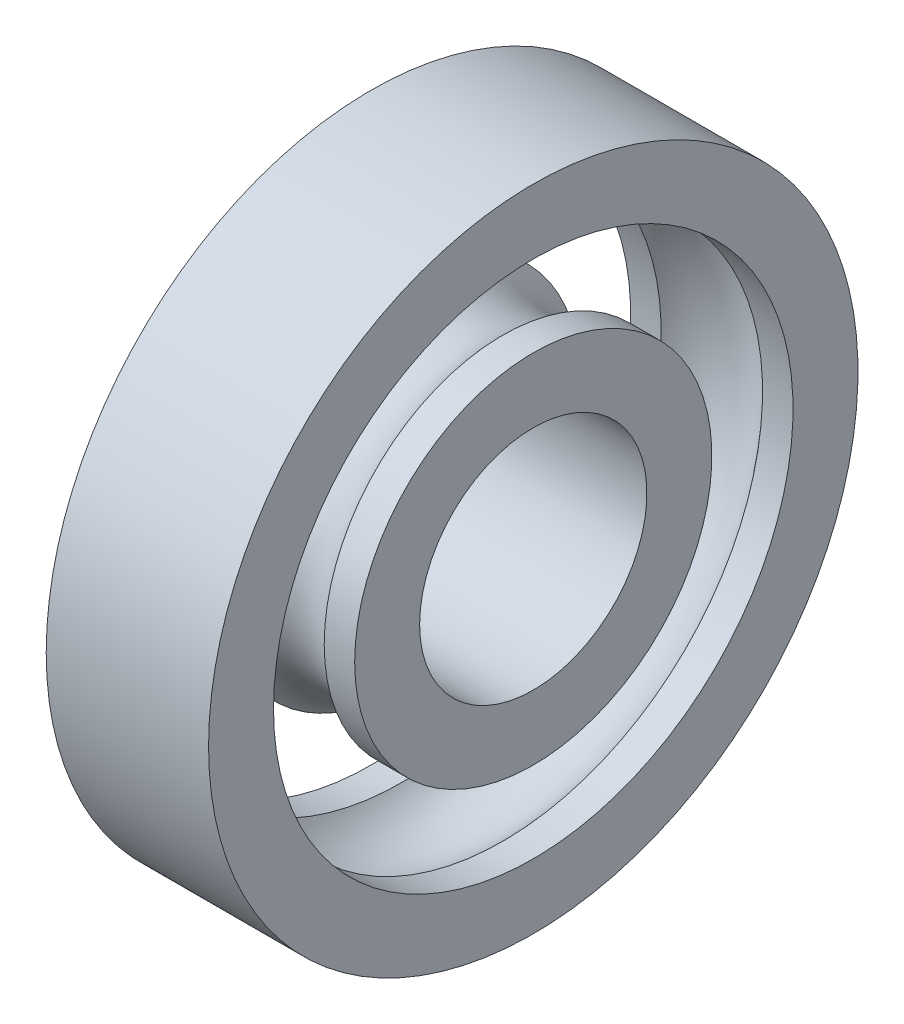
ISO-10303-21;
HEADER;
FILE_DESCRIPTION(('STEP AP214'),'2;1');
FILE_NAME('part.step','',(''),(''),'','','');
FILE_SCHEMA(('AUTOMOTIVE_DESIGN { 1 0 10303 214 1 1 1 1 }'));
ENDSEC;
DATA;
#1=APPLICATION_CONTEXT('core data for automotive mechanical design processes');
#2=APPLICATION_PROTOCOL_DEFINITION('international standard','automotive_design',2000,#1);
#3=PRODUCT_CONTEXT('',#1,'mechanical');
#4=PRODUCT('Part','Part','',(#3));
#5=PRODUCT_RELATED_PRODUCT_CATEGORY('part','',(#4));
#6=PRODUCT_DEFINITION_FORMATION('','',#4);
#7=PRODUCT_DEFINITION_CONTEXT('part definition',#1,'design');
#8=PRODUCT_DEFINITION('design','',#6,#7);
#9=PRODUCT_DEFINITION_SHAPE('','',#8);
#10=(LENGTH_UNIT() NAMED_UNIT(*) SI_UNIT(.MILLI.,.METRE.));
#11=(NAMED_UNIT(*) PLANE_ANGLE_UNIT() SI_UNIT($,.RADIAN.));
#12=(NAMED_UNIT(*) SI_UNIT($,.STERADIAN.) SOLID_ANGLE_UNIT());
#13=UNCERTAINTY_MEASURE_WITH_UNIT(LENGTH_MEASURE(1.E-05),#10,'distance_accuracy_value','');
#14=(GEOMETRIC_REPRESENTATION_CONTEXT(3) GLOBAL_UNCERTAINTY_ASSIGNED_CONTEXT((#13)) GLOBAL_UNIT_ASSIGNED_CONTEXT((#10,
#11,#12)) REPRESENTATION_CONTEXT('',''));
#15=CARTESIAN_POINT('',(0.,0.,0.));
#16=DIRECTION('',(0.,0.,1.));
#17=DIRECTION('',(1.,0.,0.));
#18=AXIS2_PLACEMENT_3D('',#15,#16,#17);
#19=CARTESIAN_POINT('',(-5.5398835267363,0.,0.));
#20=DIRECTION('',(-1.,0.,0.));
#21=DIRECTION('',(0.,0.,1.));
#22=AXIS2_PLACEMENT_3D('',#19,#20,#21);
#23=CYLINDRICAL_SURFACE('',#22,11.);
#24=CARTESIAN_POINT('',(-5.,0.,0.));
#25=DIRECTION('',(-1.,0.,0.));
#26=DIRECTION('',(0.,0.,1.));
#27=AXIS2_PLACEMENT_3D('',#24,#25,#26);
#28=CIRCLE('',#27,11.);
#29=CARTESIAN_POINT('',(-5.,0.,11.));
#30=VERTEX_POINT('',#29);
#31=EDGE_CURVE('E11',#30,#30,#28,.T.);
#32=ORIENTED_EDGE('',*,*,#31,.F.);
#33=EDGE_LOOP('',(#32));
#34=FACE_BOUND('',#33,.T.);
#35=CARTESIAN_POINT('',(-3.12249899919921,0.,0.));
#36=DIRECTION('',(-1.,0.,0.));
#37=DIRECTION('',(0.,0.,1.));
#38=AXIS2_PLACEMENT_3D('',#35,#36,#37);
#39=CIRCLE('',#38,11.);
#40=CARTESIAN_POINT('',(-3.12249899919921,0.,11.));
#41=VERTEX_POINT('',#40);
#42=EDGE_CURVE('E61',#41,#41,#39,.T.);
#43=ORIENTED_EDGE('',*,*,#42,.T.);
#44=EDGE_LOOP('',(#43));
#45=FACE_BOUND('',#44,.T.);
#46=ADVANCED_FACE('F39',(#34,#45),#23,.T.);
#47=CARTESIAN_POINT('',(-5.,7.,0.));
#48=DIRECTION('',(1.,0.,0.));
#49=DIRECTION('',(0.,0.,-1.));
#50=AXIS2_PLACEMENT_3D('',#47,#48,#49);
#51=PLANE('',#50);
#52=CARTESIAN_POINT('',(-5.,0.,0.));
#53=DIRECTION('',(-1.,0.,0.));
#54=DIRECTION('',(0.,0.,1.));
#55=AXIS2_PLACEMENT_3D('',#52,#53,#54);
#56=CIRCLE('',#55,7.);
#57=CARTESIAN_POINT('',(-5.,0.,7.));
#58=VERTEX_POINT('',#57);
#59=EDGE_CURVE('E45',#58,#58,#56,.T.);
#60=ORIENTED_EDGE('',*,*,#59,.F.);
#61=EDGE_LOOP('',(#60));
#62=FACE_BOUND('',#61,.T.);
#63=ORIENTED_EDGE('',*,*,#31,.T.);
#64=EDGE_LOOP('',(#63));
#65=FACE_BOUND('',#64,.T.);
#66=ADVANCED_FACE('F86',(#62,#65),#51,.F.);
#67=CARTESIAN_POINT('',(-5.5398835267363,0.,0.));
#68=DIRECTION('',(-1.,0.,0.));
#69=DIRECTION('',(0.,0.,1.));
#70=AXIS2_PLACEMENT_3D('',#67,#68,#69);
#71=CYLINDRICAL_SURFACE('',#70,7.);
#72=CARTESIAN_POINT('',(5.,0.,0.));
#73=DIRECTION('',(-1.,0.,0.));
#74=DIRECTION('',(0.,0.,1.));
#75=AXIS2_PLACEMENT_3D('',#72,#73,#74);
#76=CIRCLE('',#75,7.);
#77=CARTESIAN_POINT('',(5.,0.,7.));
#78=VERTEX_POINT('',#77);
#79=EDGE_CURVE('E49',#78,#78,#76,.T.);
#80=ORIENTED_EDGE('',*,*,#79,.F.);
#81=EDGE_LOOP('',(#80));
#82=FACE_BOUND('',#81,.T.);
#83=ORIENTED_EDGE('',*,*,#59,.T.);
#84=EDGE_LOOP('',(#83));
#85=FACE_BOUND('',#84,.T.);
#86=ADVANCED_FACE('F81',(#82,#85),#71,.F.);
#87=CARTESIAN_POINT('',(5.,7.,0.));
#88=DIRECTION('',(-1.,0.,0.));
#89=DIRECTION('',(0.,0.,1.));
#90=AXIS2_PLACEMENT_3D('',#87,#88,#89);
#91=PLANE('',#90);
#92=CARTESIAN_POINT('',(5.,0.,0.));
#93=DIRECTION('',(-1.,0.,0.));
#94=DIRECTION('',(0.,0.,1.));
#95=AXIS2_PLACEMENT_3D('',#92,#93,#94);
#96=CIRCLE('',#95,11.);
#97=CARTESIAN_POINT('',(5.,0.,11.));
#98=VERTEX_POINT('',#97);
#99=EDGE_CURVE('E53',#98,#98,#96,.T.);
#100=ORIENTED_EDGE('',*,*,#99,.F.);
#101=EDGE_LOOP('',(#100));
#102=FACE_BOUND('',#101,.T.);
#103=ORIENTED_EDGE('',*,*,#79,.T.);
#104=EDGE_LOOP('',(#103));
#105=FACE_BOUND('',#104,.T.);
#106=ADVANCED_FACE('F75',(#102,#105),#91,.F.);
#107=CARTESIAN_POINT('',(-5.5398835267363,0.,0.));
#108=DIRECTION('',(-1.,0.,0.));
#109=DIRECTION('',(0.,0.,1.));
#110=AXIS2_PLACEMENT_3D('',#107,#108,#109);
#111=CYLINDRICAL_SURFACE('',#110,11.);
#112=CARTESIAN_POINT('',(3.12249899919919,0.,0.));
#113=DIRECTION('',(-1.,0.,0.));
#114=DIRECTION('',(0.,0.,1.));
#115=AXIS2_PLACEMENT_3D('',#112,#113,#114);
#116=CIRCLE('',#115,11.);
#117=CARTESIAN_POINT('',(3.12249899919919,0.,11.));
#118=VERTEX_POINT('',#117);
#119=EDGE_CURVE('E58',#118,#118,#116,.T.);
#120=ORIENTED_EDGE('',*,*,#119,.F.);
#121=EDGE_LOOP('',(#120));
#122=FACE_BOUND('',#121,.T.);
#123=ORIENTED_EDGE('',*,*,#99,.T.);
#124=EDGE_LOOP('',(#123));
#125=FACE_BOUND('',#124,.T.);
#126=ADVANCED_FACE('F69',(#122,#125),#111,.T.);
#127=CARTESIAN_POINT('',(0.,0.,0.));
#128=DIRECTION('',(-1.,0.,0.));
#129=DIRECTION('',(0.,0.,1.));
#130=AXIS2_PLACEMENT_3D('',#127,#128,#129);
#131=TOROIDAL_SURFACE('',#130,13.5,4.);
#132=ORIENTED_EDGE('',*,*,#42,.F.);
#133=EDGE_LOOP('',(#132));
#134=FACE_BOUND('',#133,.T.);
#135=ORIENTED_EDGE('',*,*,#119,.T.);
#136=EDGE_LOOP('',(#135));
#137=FACE_BOUND('',#136,.T.);
#138=ADVANCED_FACE('F66',(#134,#137),#131,.F.);
#139=CLOSED_SHELL('',(#46,#66,#86,#106,#126,#138));
#140=MANIFOLD_SOLID_BREP('B2',#139);
#141=CARTESIAN_POINT('',(-4.99999999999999,16.,0.));
#142=DIRECTION('',(1.,0.,0.));
#143=DIRECTION('',(0.,0.,-1.));
#144=AXIS2_PLACEMENT_3D('',#141,#142,#143);
#145=PLANE('',#144);
#146=CARTESIAN_POINT('',(-4.99999999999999,0.,0.));
#147=DIRECTION('',(-1.,0.,0.));
#148=DIRECTION('',(0.,0.,1.));
#149=AXIS2_PLACEMENT_3D('',#146,#147,#148);
#150=CIRCLE('',#149,16.);
#151=CARTESIAN_POINT('',(-4.99999999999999,0.,16.));
#152=VERTEX_POINT('',#151);
#153=EDGE_CURVE('E38',#152,#152,#150,.T.);
#154=ORIENTED_EDGE('',*,*,#153,.F.);
#155=EDGE_LOOP('',(#154));
#156=FACE_BOUND('',#155,.T.);
#157=CARTESIAN_POINT('',(-4.99999999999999,0.,0.));
#158=DIRECTION('',(-1.,0.,0.));
#159=DIRECTION('',(0.,0.,1.));
#160=AXIS2_PLACEMENT_3D('',#157,#158,#159);
#161=CIRCLE('',#160,20.);
#162=CARTESIAN_POINT('',(-4.99999999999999,0.,20.));
#163=VERTEX_POINT('',#162);
#164=EDGE_CURVE('E153',#163,#163,#161,.T.);
#165=ORIENTED_EDGE('',*,*,#164,.T.);
#166=EDGE_LOOP('',(#165));
#167=FACE_BOUND('',#166,.T.);
#168=ADVANCED_FACE('F131',(#156,#167),#145,.F.);
#169=CARTESIAN_POINT('',(-5.5398835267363,0.,0.));
#170=DIRECTION('',(-1.,0.,0.));
#171=DIRECTION('',(0.,0.,1.));
#172=AXIS2_PLACEMENT_3D('',#169,#170,#171);
#173=CYLINDRICAL_SURFACE('',#172,16.);
#174=CARTESIAN_POINT('',(-3.12249899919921,0.,0.));
#175=DIRECTION('',(-1.,0.,0.));
#176=DIRECTION('',(0.,0.,1.));
#177=AXIS2_PLACEMENT_3D('',#174,#175,#176);
#178=CIRCLE('',#177,16.);
#179=CARTESIAN_POINT('',(-3.12249899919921,0.,16.));
#180=VERTEX_POINT('',#179);
#181=EDGE_CURVE('E137',#180,#180,#178,.T.);
#182=ORIENTED_EDGE('',*,*,#181,.F.);
#183=EDGE_LOOP('',(#182));
#184=FACE_BOUND('',#183,.T.);
#185=ORIENTED_EDGE('',*,*,#153,.T.);
#186=EDGE_LOOP('',(#185));
#187=FACE_BOUND('',#186,.T.);
#188=ADVANCED_FACE('F178',(#184,#187),#173,.F.);
#189=CARTESIAN_POINT('',(0.,0.,0.));
#190=DIRECTION('',(-1.,0.,0.));
#191=DIRECTION('',(0.,0.,1.));
#192=AXIS2_PLACEMENT_3D('',#189,#190,#191);
#193=TOROIDAL_SURFACE('',#192,13.5,4.);
#194=CARTESIAN_POINT('',(3.12249899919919,0.,0.));
#195=DIRECTION('',(-1.,0.,0.));
#196=DIRECTION('',(0.,0.,1.));
#197=AXIS2_PLACEMENT_3D('',#194,#195,#196);
#198=CIRCLE('',#197,16.);
#199=CARTESIAN_POINT('',(3.12249899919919,0.,16.));
#200=VERTEX_POINT('',#199);
#201=EDGE_CURVE('E141',#200,#200,#198,.T.);
#202=ORIENTED_EDGE('',*,*,#201,.F.);
#203=EDGE_LOOP('',(#202));
#204=FACE_BOUND('',#203,.T.);
#205=ORIENTED_EDGE('',*,*,#181,.T.);
#206=EDGE_LOOP('',(#205));
#207=FACE_BOUND('',#206,.T.);
#208=ADVANCED_FACE('F173',(#204,#207),#193,.F.);
#209=CARTESIAN_POINT('',(-5.5398835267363,0.,0.));
#210=DIRECTION('',(-1.,0.,0.));
#211=DIRECTION('',(0.,0.,1.));
#212=AXIS2_PLACEMENT_3D('',#209,#210,#211);
#213=CYLINDRICAL_SURFACE('',#212,16.);
#214=CARTESIAN_POINT('',(5.00000000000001,0.,0.));
#215=DIRECTION('',(-1.,0.,0.));
#216=DIRECTION('',(0.,0.,1.));
#217=AXIS2_PLACEMENT_3D('',#214,#215,#216);
#218=CIRCLE('',#217,16.);
#219=CARTESIAN_POINT('',(5.00000000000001,0.,16.));
#220=VERTEX_POINT('',#219);
#221=EDGE_CURVE('E145',#220,#220,#218,.T.);
#222=ORIENTED_EDGE('',*,*,#221,.F.);
#223=EDGE_LOOP('',(#222));
#224=FACE_BOUND('',#223,.T.);
#225=ORIENTED_EDGE('',*,*,#201,.T.);
#226=EDGE_LOOP('',(#225));
#227=FACE_BOUND('',#226,.T.);
#228=ADVANCED_FACE('F167',(#224,#227),#213,.F.);
#229=CARTESIAN_POINT('',(5.00000000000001,16.,0.));
#230=DIRECTION('',(-1.,0.,0.));
#231=DIRECTION('',(0.,0.,1.));
#232=AXIS2_PLACEMENT_3D('',#229,#230,#231);
#233=PLANE('',#232);
#234=CARTESIAN_POINT('',(5.00000000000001,0.,0.));
#235=DIRECTION('',(-1.,0.,0.));
#236=DIRECTION('',(0.,0.,1.));
#237=AXIS2_PLACEMENT_3D('',#234,#235,#236);
#238=CIRCLE('',#237,20.);
#239=CARTESIAN_POINT('',(5.00000000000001,0.,20.));
#240=VERTEX_POINT('',#239);
#241=EDGE_CURVE('E150',#240,#240,#238,.T.);
#242=ORIENTED_EDGE('',*,*,#241,.F.);
#243=EDGE_LOOP('',(#242));
#244=FACE_BOUND('',#243,.T.);
#245=ORIENTED_EDGE('',*,*,#221,.T.);
#246=EDGE_LOOP('',(#245));
#247=FACE_BOUND('',#246,.T.);
#248=ADVANCED_FACE('F161',(#244,#247),#233,.F.);
#249=CARTESIAN_POINT('',(-5.5398835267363,0.,0.));
#250=DIRECTION('',(-1.,0.,0.));
#251=DIRECTION('',(0.,0.,1.));
#252=AXIS2_PLACEMENT_3D('',#249,#250,#251);
#253=CYLINDRICAL_SURFACE('',#252,20.);
#254=ORIENTED_EDGE('',*,*,#164,.F.);
#255=EDGE_LOOP('',(#254));
#256=FACE_BOUND('',#255,.T.);
#257=ORIENTED_EDGE('',*,*,#241,.T.);
#258=EDGE_LOOP('',(#257));
#259=FACE_BOUND('',#258,.T.);
#260=ADVANCED_FACE('F158',(#256,#259),#253,.T.);
#261=CLOSED_SHELL('',(#168,#188,#208,#228,#248,#260));
#262=MANIFOLD_SOLID_BREP('B6',#261);
#263=ADVANCED_BREP_SHAPE_REPRESENTATION('',(#18,#140,#262),#14);
#264=SHAPE_DEFINITION_REPRESENTATION(#9,#263);
ENDSEC;
END-ISO-10303-21;
